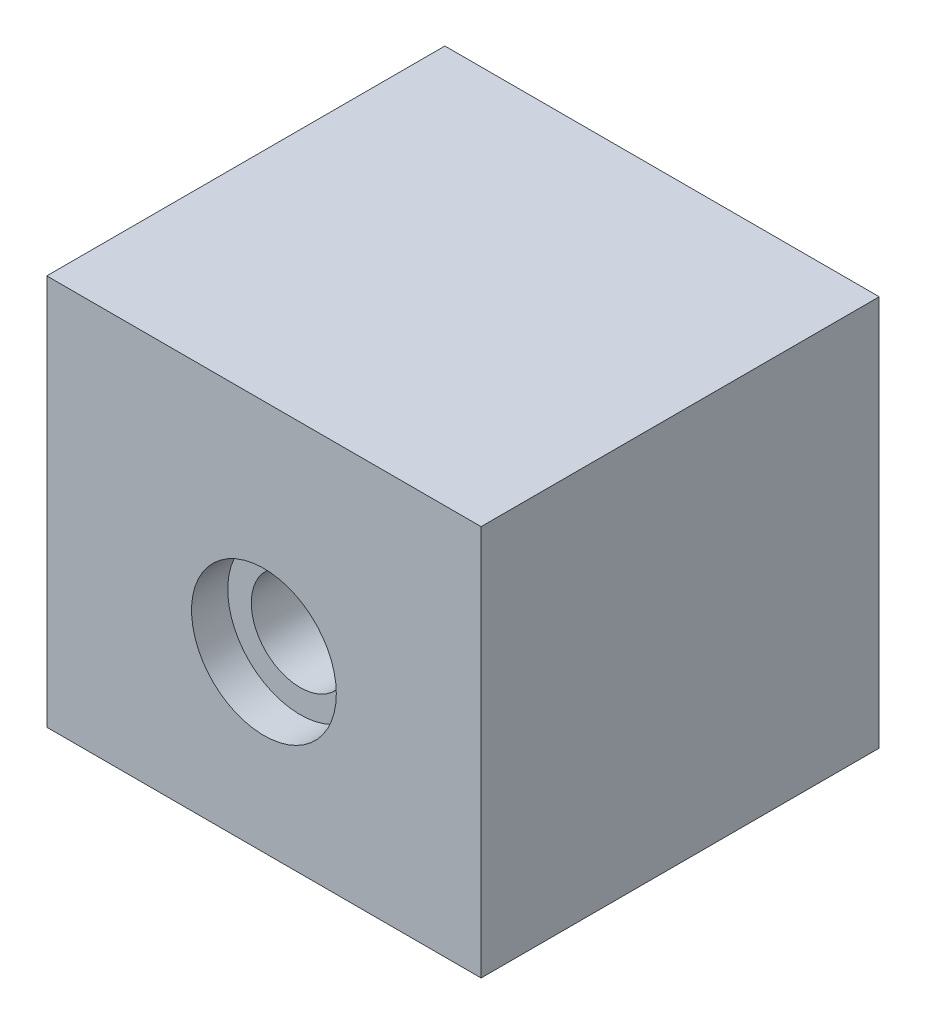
ISO-10303-21;
HEADER;
FILE_DESCRIPTION(('STEP AP214'),'2;1');
FILE_NAME('part.step','',(''),(''),'','','');
FILE_SCHEMA(('AUTOMOTIVE_DESIGN { 1 0 10303 214 1 1 1 1 }'));
ENDSEC;
DATA;
#1=APPLICATION_CONTEXT('core data for automotive mechanical design processes');
#2=APPLICATION_PROTOCOL_DEFINITION('international standard','automotive_design',2000,#1);
#3=PRODUCT_CONTEXT('',#1,'mechanical');
#4=PRODUCT('Part','Part','',(#3));
#5=PRODUCT_RELATED_PRODUCT_CATEGORY('part','',(#4));
#6=PRODUCT_DEFINITION_FORMATION('','',#4);
#7=PRODUCT_DEFINITION_CONTEXT('part definition',#1,'design');
#8=PRODUCT_DEFINITION('design','',#6,#7);
#9=PRODUCT_DEFINITION_SHAPE('','',#8);
#10=(LENGTH_UNIT() NAMED_UNIT(*) SI_UNIT(.MILLI.,.METRE.));
#11=(NAMED_UNIT(*) PLANE_ANGLE_UNIT() SI_UNIT($,.RADIAN.));
#12=(NAMED_UNIT(*) SI_UNIT($,.STERADIAN.) SOLID_ANGLE_UNIT());
#13=UNCERTAINTY_MEASURE_WITH_UNIT(LENGTH_MEASURE(1.E-05),#10,'distance_accuracy_value','');
#14=(GEOMETRIC_REPRESENTATION_CONTEXT(3) GLOBAL_UNCERTAINTY_ASSIGNED_CONTEXT((#13)) GLOBAL_UNIT_ASSIGNED_CONTEXT((#10,
#11,#12)) REPRESENTATION_CONTEXT('',''));
#15=CARTESIAN_POINT('',(0.,0.,0.));
#16=DIRECTION('',(0.,0.,1.));
#17=DIRECTION('',(1.,0.,0.));
#18=AXIS2_PLACEMENT_3D('',#15,#16,#17);
#19=CARTESIAN_POINT('',(0.,0.,13.75));
#20=DIRECTION('',(0.,0.,-1.));
#21=DIRECTION('',(-1.,0.,0.));
#22=AXIS2_PLACEMENT_3D('',#19,#20,#21);
#23=CYLINDRICAL_SURFACE('',#22,3.375);
#24=CARTESIAN_POINT('',(0.,0.,-13.75));
#25=DIRECTION('',(0.,0.,1.));
#26=DIRECTION('',(1.,0.,0.));
#27=AXIS2_PLACEMENT_3D('',#24,#25,#26);
#28=CIRCLE('',#27,3.375);
#29=CARTESIAN_POINT('',(3.375,0.,-13.75));
#30=VERTEX_POINT('',#29);
#31=EDGE_CURVE('E88',#30,#30,#28,.T.);
#32=ORIENTED_EDGE('',*,*,#31,.F.);
#33=EDGE_LOOP('',(#32));
#34=FACE_BOUND('',#33,.T.);
#35=CARTESIAN_POINT('',(0.,0.,11.25));
#36=DIRECTION('',(0.,0.,1.));
#37=DIRECTION('',(1.,0.,0.));
#38=AXIS2_PLACEMENT_3D('',#35,#36,#37);
#39=CIRCLE('',#38,3.375);
#40=CARTESIAN_POINT('',(3.375,0.,11.25));
#41=VERTEX_POINT('',#40);
#42=EDGE_CURVE('E32',#41,#41,#39,.T.);
#43=ORIENTED_EDGE('',*,*,#42,.T.);
#44=EDGE_LOOP('',(#43));
#45=FACE_BOUND('',#44,.T.);
#46=ADVANCED_FACE('F28',(#34,#45),#23,.F.);
#47=CARTESIAN_POINT('',(-15.,-12.,13.75));
#48=DIRECTION('',(0.,0.,1.));
#49=DIRECTION('',(1.,0.,0.));
#50=AXIS2_PLACEMENT_3D('',#47,#48,#49);
#51=PLANE('',#50);
#52=CARTESIAN_POINT('',(0.,0.,13.75));
#53=DIRECTION('',(0.,0.,1.));
#54=DIRECTION('',(1.,0.,0.));
#55=AXIS2_PLACEMENT_3D('',#52,#53,#54);
#56=CIRCLE('',#55,5.);
#57=CARTESIAN_POINT('',(5.,0.,13.75));
#58=VERTEX_POINT('',#57);
#59=EDGE_CURVE('E176',#58,#58,#56,.T.);
#60=ORIENTED_EDGE('',*,*,#59,.F.);
#61=EDGE_LOOP('',(#60));
#62=FACE_BOUND('',#61,.T.);
#63=DIRECTION('',(0.,-1.,0.));
#64=VECTOR('',#63,1.);
#65=CARTESIAN_POINT('',(-15.,15.,13.75));
#66=LINE('',#65,#64);
#67=CARTESIAN_POINT('',(-15.,15.,13.75));
#68=VERTEX_POINT('',#67);
#69=CARTESIAN_POINT('',(-15.,-12.,13.75));
#70=VERTEX_POINT('',#69);
#71=EDGE_CURVE('E97',#68,#70,#66,.T.);
#72=ORIENTED_EDGE('',*,*,#71,.T.);
#73=DIRECTION('',(1.,0.,0.));
#74=VECTOR('',#73,1.);
#75=CARTESIAN_POINT('',(-15.,-12.,13.75));
#76=LINE('',#75,#74);
#77=CARTESIAN_POINT('',(15.,-12.,13.75));
#78=VERTEX_POINT('',#77);
#79=EDGE_CURVE('E83',#70,#78,#76,.T.);
#80=ORIENTED_EDGE('',*,*,#79,.T.);
#81=DIRECTION('',(0.,1.,0.));
#82=VECTOR('',#81,1.);
#83=CARTESIAN_POINT('',(15.,15.,13.75));
#84=LINE('',#83,#82);
#85=CARTESIAN_POINT('',(15.,15.,13.75));
#86=VERTEX_POINT('',#85);
#87=EDGE_CURVE('E49',#78,#86,#84,.T.);
#88=ORIENTED_EDGE('',*,*,#87,.T.);
#89=DIRECTION('',(-1.,0.,0.));
#90=VECTOR('',#89,1.);
#91=CARTESIAN_POINT('',(-15.,15.,13.75));
#92=LINE('',#91,#90);
#93=EDGE_CURVE('E44',#86,#68,#92,.T.);
#94=ORIENTED_EDGE('',*,*,#93,.T.);
#95=EDGE_LOOP('',(#72,#80,#88,#94));
#96=FACE_BOUND('',#95,.T.);
#97=ADVANCED_FACE('F110',(#62,#96),#51,.T.);
#98=CARTESIAN_POINT('',(-15.,-12.,-13.75));
#99=DIRECTION('',(0.,0.,1.));
#100=DIRECTION('',(1.,0.,0.));
#101=AXIS2_PLACEMENT_3D('',#98,#99,#100);
#102=PLANE('',#101);
#103=DIRECTION('',(0.,-1.,0.));
#104=VECTOR('',#103,1.);
#105=CARTESIAN_POINT('',(-15.,15.,-13.75));
#106=LINE('',#105,#104);
#107=CARTESIAN_POINT('',(-15.,15.,-13.75));
#108=VERTEX_POINT('',#107);
#109=CARTESIAN_POINT('',(-15.,-12.,-13.75));
#110=VERTEX_POINT('',#109);
#111=EDGE_CURVE('E75',#108,#110,#106,.T.);
#112=ORIENTED_EDGE('',*,*,#111,.F.);
#113=DIRECTION('',(-1.,0.,0.));
#114=VECTOR('',#113,1.);
#115=CARTESIAN_POINT('',(-15.,15.,-13.75));
#116=LINE('',#115,#114);
#117=CARTESIAN_POINT('',(15.,15.,-13.75));
#118=VERTEX_POINT('',#117);
#119=EDGE_CURVE('E95',#118,#108,#116,.T.);
#120=ORIENTED_EDGE('',*,*,#119,.F.);
#121=DIRECTION('',(0.,1.,0.));
#122=VECTOR('',#121,1.);
#123=CARTESIAN_POINT('',(15.,15.,-13.75));
#124=LINE('',#123,#122);
#125=CARTESIAN_POINT('',(15.,-12.,-13.75));
#126=VERTEX_POINT('',#125);
#127=EDGE_CURVE('E76',#126,#118,#124,.T.);
#128=ORIENTED_EDGE('',*,*,#127,.F.);
#129=DIRECTION('',(1.,0.,0.));
#130=VECTOR('',#129,1.);
#131=CARTESIAN_POINT('',(-15.,-12.,-13.75));
#132=LINE('',#131,#130);
#133=EDGE_CURVE('E70',#110,#126,#132,.T.);
#134=ORIENTED_EDGE('',*,*,#133,.F.);
#135=EDGE_LOOP('',(#112,#120,#128,#134));
#136=FACE_BOUND('',#135,.T.);
#137=ORIENTED_EDGE('',*,*,#31,.T.);
#138=EDGE_LOOP('',(#137));
#139=FACE_BOUND('',#138,.T.);
#140=ADVANCED_FACE('F71',(#136,#139),#102,.F.);
#141=CARTESIAN_POINT('',(-15.,15.,13.75));
#142=DIRECTION('',(1.,0.,0.));
#143=DIRECTION('',(0.,1.,0.));
#144=AXIS2_PLACEMENT_3D('',#141,#142,#143);
#145=PLANE('',#144);
#146=ORIENTED_EDGE('',*,*,#111,.T.);
#147=DIRECTION('',(0.,0.,-1.));
#148=VECTOR('',#147,1.);
#149=CARTESIAN_POINT('',(-15.,-12.,13.75));
#150=LINE('',#149,#148);
#151=EDGE_CURVE('E11',#70,#110,#150,.T.);
#152=ORIENTED_EDGE('',*,*,#151,.F.);
#153=ORIENTED_EDGE('',*,*,#71,.F.);
#154=DIRECTION('',(0.,0.,-1.));
#155=VECTOR('',#154,1.);
#156=CARTESIAN_POINT('',(-15.,15.,13.75));
#157=LINE('',#156,#155);
#158=EDGE_CURVE('E87',#68,#108,#157,.T.);
#159=ORIENTED_EDGE('',*,*,#158,.T.);
#160=EDGE_LOOP('',(#146,#152,#153,#159));
#161=FACE_BOUND('',#160,.T.);
#162=ADVANCED_FACE('F30',(#161),#145,.F.);
#163=CARTESIAN_POINT('',(-15.,-12.,13.75));
#164=DIRECTION('',(0.,1.,0.));
#165=DIRECTION('',(-1.,0.,0.));
#166=AXIS2_PLACEMENT_3D('',#163,#164,#165);
#167=PLANE('',#166);
#168=ORIENTED_EDGE('',*,*,#133,.T.);
#169=DIRECTION('',(0.,0.,-1.));
#170=VECTOR('',#169,1.);
#171=CARTESIAN_POINT('',(15.,-12.,13.75));
#172=LINE('',#171,#170);
#173=EDGE_CURVE('E37',#78,#126,#172,.T.);
#174=ORIENTED_EDGE('',*,*,#173,.F.);
#175=ORIENTED_EDGE('',*,*,#79,.F.);
#176=ORIENTED_EDGE('',*,*,#151,.T.);
#177=EDGE_LOOP('',(#168,#174,#175,#176));
#178=FACE_BOUND('',#177,.T.);
#179=ADVANCED_FACE('F82',(#178),#167,.F.);
#180=CARTESIAN_POINT('',(15.,15.,13.75));
#181=DIRECTION('',(-1.,0.,0.));
#182=DIRECTION('',(0.,-1.,0.));
#183=AXIS2_PLACEMENT_3D('',#180,#181,#182);
#184=PLANE('',#183);
#185=ORIENTED_EDGE('',*,*,#127,.T.);
#186=DIRECTION('',(0.,0.,-1.));
#187=VECTOR('',#186,1.);
#188=CARTESIAN_POINT('',(15.,15.,13.75));
#189=LINE('',#188,#187);
#190=EDGE_CURVE('E103',#86,#118,#189,.T.);
#191=ORIENTED_EDGE('',*,*,#190,.F.);
#192=ORIENTED_EDGE('',*,*,#87,.F.);
#193=ORIENTED_EDGE('',*,*,#173,.T.);
#194=EDGE_LOOP('',(#185,#191,#192,#193));
#195=FACE_BOUND('',#194,.T.);
#196=ADVANCED_FACE('F107',(#195),#184,.F.);
#197=CARTESIAN_POINT('',(-15.,15.,13.75));
#198=DIRECTION('',(0.,-1.,0.));
#199=DIRECTION('',(0.,0.,-1.));
#200=AXIS2_PLACEMENT_3D('',#197,#198,#199);
#201=PLANE('',#200);
#202=ORIENTED_EDGE('',*,*,#119,.T.);
#203=ORIENTED_EDGE('',*,*,#158,.F.);
#204=ORIENTED_EDGE('',*,*,#93,.F.);
#205=ORIENTED_EDGE('',*,*,#190,.T.);
#206=EDGE_LOOP('',(#202,#203,#204,#205));
#207=FACE_BOUND('',#206,.T.);
#208=ADVANCED_FACE('F109',(#207),#201,.F.);
#209=CARTESIAN_POINT('',(0.,0.,11.25));
#210=DIRECTION('',(0.,0.,1.));
#211=DIRECTION('',(1.,0.,0.));
#212=AXIS2_PLACEMENT_3D('',#209,#210,#211);
#213=CYLINDRICAL_SURFACE('',#212,5.);
#214=CARTESIAN_POINT('',(0.,0.,11.25));
#215=DIRECTION('',(0.,0.,1.));
#216=DIRECTION('',(1.,0.,0.));
#217=AXIS2_PLACEMENT_3D('',#214,#215,#216);
#218=CIRCLE('',#217,5.);
#219=CARTESIAN_POINT('',(5.,0.,11.25));
#220=VERTEX_POINT('',#219);
#221=EDGE_CURVE('E175',#220,#220,#218,.T.);
#222=ORIENTED_EDGE('',*,*,#221,.F.);
#223=EDGE_LOOP('',(#222));
#224=FACE_BOUND('',#223,.T.);
#225=ORIENTED_EDGE('',*,*,#59,.T.);
#226=EDGE_LOOP('',(#225));
#227=FACE_BOUND('',#226,.T.);
#228=ADVANCED_FACE('F125',(#224,#227),#213,.F.);
#229=CARTESIAN_POINT('',(0.,0.,11.25));
#230=DIRECTION('',(0.,0.,1.));
#231=DIRECTION('',(1.,0.,0.));
#232=AXIS2_PLACEMENT_3D('',#229,#230,#231);
#233=PLANE('',#232);
#234=ORIENTED_EDGE('',*,*,#42,.F.);
#235=EDGE_LOOP('',(#234));
#236=FACE_BOUND('',#235,.T.);
#237=ORIENTED_EDGE('',*,*,#221,.T.);
#238=EDGE_LOOP('',(#237));
#239=FACE_BOUND('',#238,.T.);
#240=ADVANCED_FACE('F160',(#236,#239),#233,.T.);
#241=CLOSED_SHELL('',(#46,#97,#140,#162,#179,#196,#208,#228,#240));
#242=MANIFOLD_SOLID_BREP('B2',#241);
#243=ADVANCED_BREP_SHAPE_REPRESENTATION('',(#18,#242),#14);
#244=SHAPE_DEFINITION_REPRESENTATION(#9,#243);
ENDSEC;
END-ISO-10303-21;
